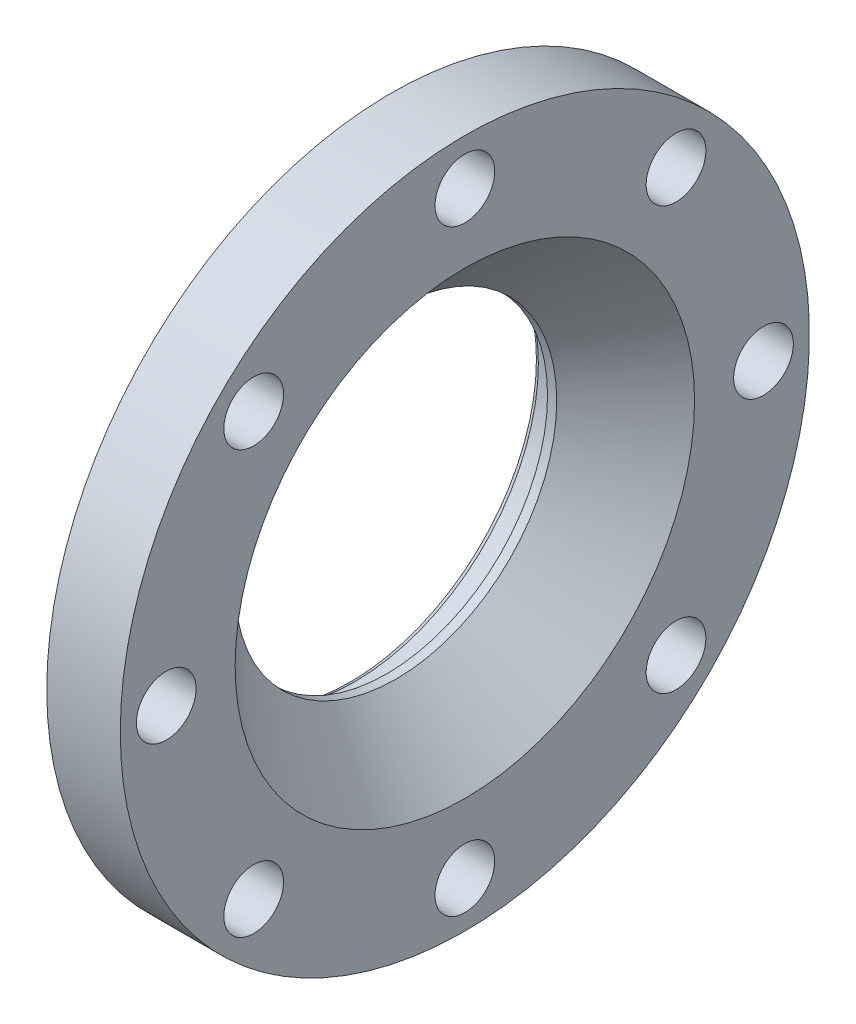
from build123d import *

# Parameters (mm, degrees)
ESQUISSE2_R             = 6.5
ENL_V_MAT_EXTRU_1_DEPTH = 110.69958979
CHANFREIN1_SIZE         = 1
CHANFREIN1_SIZE2        = 0.577350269


with BuildPart() as part:
    # Esquisse1 → R_volution1 (revolve)
    with BuildSketch(Plane.XY, mode=Mode.PRIVATE) as r_volution1_sk:
        Polygon((0, 47.5), (0, 55), (3, 55), (3, 51.9), (7.8, 51.9), (7.8, 55), (12, 55), (12, 75), (28, 75), (28, 50), (13, 35), (11, 35), (11, 40), (3, 40), (3, 47.5), align=None)
    revolve(r_volution1_sk.sketch.rotate(Axis((0, 0, 0), (1, 0, 0)), 90), axis=Axis((0, 0, 0), (1, 0, 0)))

    # Esquisse2 → Enl_v. mat.-Extru.1 (cut, through all)
    with BuildSketch(Plane(origin=(28, 0, 0), x_dir=(0, 0, -1), z_dir=(1, 0, 0))):
        with Locations((0, 65)):
            Circle(ESQUISSE2_R)
        with Locations((45.961940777, 45.961940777)):
            Circle(ESQUISSE2_R)
        with Locations((65, 0)):
            Circle(ESQUISSE2_R)
        with Locations((45.961940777, -45.961940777)):
            Circle(ESQUISSE2_R)
        with Locations((0, -65)):
            Circle(ESQUISSE2_R)
        with Locations((-45.961940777, -45.961940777)):
            Circle(ESQUISSE2_R)
        with Locations((-65, 0)):
            Circle(ESQUISSE2_R)
        with Locations((-45.961940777, 45.961940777)):
            Circle(ESQUISSE2_R)
    extrude(amount=-ENL_V_MAT_EXTRU_1_DEPTH, mode=Mode.SUBTRACT)

    # Chanfrein1
    chanfrein1_edges = [part.edges().sort_by_distance(p)[0] for p in [
        (3, 0, -40),
    ]]
    chanfrein1_side = [part.faces().sort_by_distance(p)[0] for p in [
        (7, 0, -40),
    ]]
    chamfer(chanfrein1_edges, length=CHANFREIN1_SIZE, length2=CHANFREIN1_SIZE2, reference=chanfrein1_side[0])


solid = part.part
